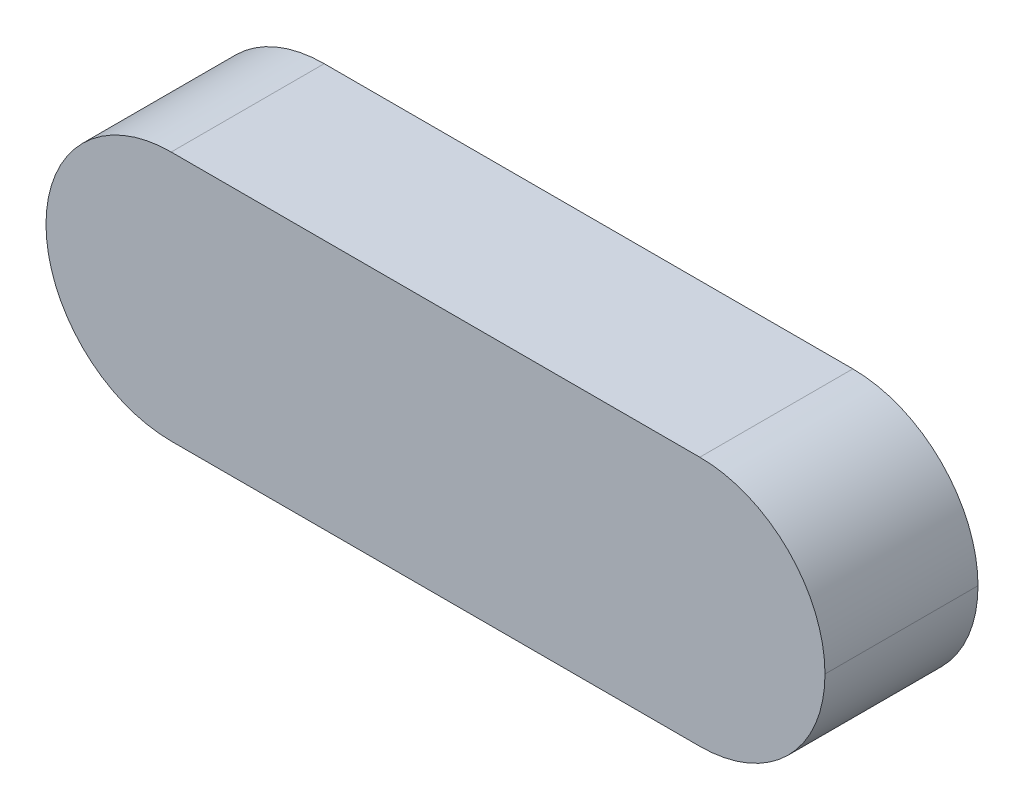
ISO-10303-21;
HEADER;
FILE_DESCRIPTION(('STEP AP214'),'2;1');
FILE_NAME('part.step','',(''),(''),'','','');
FILE_SCHEMA(('AUTOMOTIVE_DESIGN { 1 0 10303 214 1 1 1 1 }'));
ENDSEC;
DATA;
#1=APPLICATION_CONTEXT('core data for automotive mechanical design processes');
#2=APPLICATION_PROTOCOL_DEFINITION('international standard','automotive_design',2000,#1);
#3=PRODUCT_CONTEXT('',#1,'mechanical');
#4=PRODUCT('Part','Part','',(#3));
#5=PRODUCT_RELATED_PRODUCT_CATEGORY('part','',(#4));
#6=PRODUCT_DEFINITION_FORMATION('','',#4);
#7=PRODUCT_DEFINITION_CONTEXT('part definition',#1,'design');
#8=PRODUCT_DEFINITION('design','',#6,#7);
#9=PRODUCT_DEFINITION_SHAPE('','',#8);
#10=(LENGTH_UNIT() NAMED_UNIT(*) SI_UNIT(.MILLI.,.METRE.));
#11=(NAMED_UNIT(*) PLANE_ANGLE_UNIT() SI_UNIT($,.RADIAN.));
#12=(NAMED_UNIT(*) SI_UNIT($,.STERADIAN.) SOLID_ANGLE_UNIT());
#13=UNCERTAINTY_MEASURE_WITH_UNIT(LENGTH_MEASURE(1.E-05),#10,'distance_accuracy_value','');
#14=(GEOMETRIC_REPRESENTATION_CONTEXT(3) GLOBAL_UNCERTAINTY_ASSIGNED_CONTEXT((#13)) GLOBAL_UNIT_ASSIGNED_CONTEXT((#10,
#11,#12)) REPRESENTATION_CONTEXT('',''));
#15=CARTESIAN_POINT('',(0.,0.,0.));
#16=DIRECTION('',(0.,0.,1.));
#17=DIRECTION('',(1.,0.,0.));
#18=AXIS2_PLACEMENT_3D('',#15,#16,#17);
#19=CARTESIAN_POINT('',(28.,9.,11.));
#20=DIRECTION('',(0.,-1.,0.));
#21=DIRECTION('',(1.,0.,0.));
#22=AXIS2_PLACEMENT_3D('',#19,#20,#21);
#23=PLANE('',#22);
#24=DIRECTION('',(-1.,0.,0.));
#25=VECTOR('',#24,1.);
#26=CARTESIAN_POINT('',(28.,9.,0.));
#27=LINE('',#26,#25);
#28=CARTESIAN_POINT('',(19.,9.,0.));
#29=VERTEX_POINT('',#28);
#30=CARTESIAN_POINT('',(-19.,8.99999999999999,0.));
#31=VERTEX_POINT('',#30);
#32=EDGE_CURVE('E111',#29,#31,#27,.T.);
#33=ORIENTED_EDGE('',*,*,#32,.T.);
#34=DIRECTION('',(0.,0.,-1.));
#35=VECTOR('',#34,1.);
#36=CARTESIAN_POINT('',(-19.,8.99999999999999,11.));
#37=LINE('',#36,#35);
#38=CARTESIAN_POINT('',(-19.,8.99999999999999,11.));
#39=VERTEX_POINT('',#38);
#40=EDGE_CURVE('E11',#31,#39,#37,.F.);
#41=ORIENTED_EDGE('',*,*,#40,.T.);
#42=DIRECTION('',(-1.,0.,0.));
#43=VECTOR('',#42,1.);
#44=CARTESIAN_POINT('',(28.,9.,11.));
#45=LINE('',#44,#43);
#46=CARTESIAN_POINT('',(19.,9.,11.));
#47=VERTEX_POINT('',#46);
#48=EDGE_CURVE('E110',#47,#39,#45,.T.);
#49=ORIENTED_EDGE('',*,*,#48,.F.);
#50=DIRECTION('',(0.,0.,-1.));
#51=VECTOR('',#50,1.);
#52=CARTESIAN_POINT('',(19.,9.,11.));
#53=LINE('',#52,#51);
#54=EDGE_CURVE('E42',#47,#29,#53,.T.);
#55=ORIENTED_EDGE('',*,*,#54,.T.);
#56=EDGE_LOOP('',(#33,#41,#49,#55));
#57=FACE_BOUND('',#56,.T.);
#58=ADVANCED_FACE('F33',(#57),#23,.F.);
#59=CARTESIAN_POINT('',(28.,-9.,11.));
#60=DIRECTION('',(0.,-1.,0.));
#61=DIRECTION('',(1.,0.,0.));
#62=AXIS2_PLACEMENT_3D('',#59,#60,#61);
#63=PLANE('',#62);
#64=DIRECTION('',(-1.,0.,0.));
#65=VECTOR('',#64,1.);
#66=CARTESIAN_POINT('',(28.,-9.,11.));
#67=LINE('',#66,#65);
#68=CARTESIAN_POINT('',(19.,-9.,11.));
#69=VERTEX_POINT('',#68);
#70=CARTESIAN_POINT('',(-19.,-9.00000000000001,11.));
#71=VERTEX_POINT('',#70);
#72=EDGE_CURVE('E115',#69,#71,#67,.T.);
#73=ORIENTED_EDGE('',*,*,#72,.T.);
#74=DIRECTION('',(0.,0.,-1.));
#75=VECTOR('',#74,1.);
#76=CARTESIAN_POINT('',(-19.,-9.00000000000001,11.));
#77=LINE('',#76,#75);
#78=CARTESIAN_POINT('',(-19.,-9.00000000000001,0.));
#79=VERTEX_POINT('',#78);
#80=EDGE_CURVE('E109',#71,#79,#77,.T.);
#81=ORIENTED_EDGE('',*,*,#80,.T.);
#82=DIRECTION('',(-1.,0.,0.));
#83=VECTOR('',#82,1.);
#84=CARTESIAN_POINT('',(28.,-9.,0.));
#85=LINE('',#84,#83);
#86=CARTESIAN_POINT('',(19.,-9.,0.));
#87=VERTEX_POINT('',#86);
#88=EDGE_CURVE('E91',#87,#79,#85,.T.);
#89=ORIENTED_EDGE('',*,*,#88,.F.);
#90=DIRECTION('',(0.,0.,-1.));
#91=VECTOR('',#90,1.);
#92=CARTESIAN_POINT('',(19.,-9.,11.));
#93=LINE('',#92,#91);
#94=EDGE_CURVE('E106',#87,#69,#93,.F.);
#95=ORIENTED_EDGE('',*,*,#94,.T.);
#96=EDGE_LOOP('',(#73,#81,#89,#95));
#97=FACE_BOUND('',#96,.T.);
#98=ADVANCED_FACE('F105',(#97),#63,.T.);
#99=CARTESIAN_POINT('',(0.,0.,11.));
#100=DIRECTION('',(0.,0.,1.));
#101=DIRECTION('',(1.,0.,0.));
#102=AXIS2_PLACEMENT_3D('',#99,#100,#101);
#103=PLANE('',#102);
#104=CARTESIAN_POINT('',(-19.,0.,11.));
#105=DIRECTION('',(0.,0.,1.));
#106=DIRECTION('',(1.,0.,0.));
#107=AXIS2_PLACEMENT_3D('',#104,#105,#106);
#108=CIRCLE('',#107,9.);
#109=CARTESIAN_POINT('',(-28.,0.,11.));
#110=VERTEX_POINT('',#109);
#111=EDGE_CURVE('E50',#39,#110,#108,.T.);
#112=ORIENTED_EDGE('',*,*,#111,.T.);
#113=CARTESIAN_POINT('',(-19.,0.,11.));
#114=DIRECTION('',(0.,0.,1.));
#115=DIRECTION('',(1.,0.,0.));
#116=AXIS2_PLACEMENT_3D('',#113,#114,#115);
#117=CIRCLE('',#116,9.);
#118=EDGE_CURVE('E129',#110,#71,#117,.T.);
#119=ORIENTED_EDGE('',*,*,#118,.T.);
#120=ORIENTED_EDGE('',*,*,#72,.F.);
#121=CARTESIAN_POINT('',(19.,0.,11.));
#122=DIRECTION('',(0.,0.,1.));
#123=DIRECTION('',(1.,0.,0.));
#124=AXIS2_PLACEMENT_3D('',#121,#122,#123);
#125=CIRCLE('',#124,9.);
#126=CARTESIAN_POINT('',(28.,0.,11.));
#127=VERTEX_POINT('',#126);
#128=EDGE_CURVE('E114',#69,#127,#125,.T.);
#129=ORIENTED_EDGE('',*,*,#128,.T.);
#130=CARTESIAN_POINT('',(19.,0.,11.));
#131=DIRECTION('',(0.,0.,1.));
#132=DIRECTION('',(1.,0.,0.));
#133=AXIS2_PLACEMENT_3D('',#130,#131,#132);
#134=CIRCLE('',#133,9.);
#135=EDGE_CURVE('E125',#127,#47,#134,.T.);
#136=ORIENTED_EDGE('',*,*,#135,.T.);
#137=ORIENTED_EDGE('',*,*,#48,.T.);
#138=EDGE_LOOP('',(#112,#119,#120,#129,#136,#137));
#139=FACE_BOUND('',#138,.T.);
#140=ADVANCED_FACE('F138',(#139),#103,.T.);
#141=CARTESIAN_POINT('',(0.,0.,0.));
#142=DIRECTION('',(0.,0.,1.));
#143=DIRECTION('',(1.,0.,0.));
#144=AXIS2_PLACEMENT_3D('',#141,#142,#143);
#145=PLANE('',#144);
#146=ORIENTED_EDGE('',*,*,#88,.T.);
#147=CARTESIAN_POINT('',(-19.,0.,0.));
#148=DIRECTION('',(0.,0.,1.));
#149=DIRECTION('',(1.,0.,0.));
#150=AXIS2_PLACEMENT_3D('',#147,#148,#149);
#151=CIRCLE('',#150,9.);
#152=CARTESIAN_POINT('',(-28.,0.,0.));
#153=VERTEX_POINT('',#152);
#154=EDGE_CURVE('E123',#79,#153,#151,.F.);
#155=ORIENTED_EDGE('',*,*,#154,.T.);
#156=CARTESIAN_POINT('',(-19.,0.,0.));
#157=DIRECTION('',(0.,0.,1.));
#158=DIRECTION('',(1.,0.,0.));
#159=AXIS2_PLACEMENT_3D('',#156,#157,#158);
#160=CIRCLE('',#159,9.);
#161=EDGE_CURVE('E99',#153,#31,#160,.F.);
#162=ORIENTED_EDGE('',*,*,#161,.T.);
#163=ORIENTED_EDGE('',*,*,#32,.F.);
#164=CARTESIAN_POINT('',(19.,0.,0.));
#165=DIRECTION('',(0.,0.,1.));
#166=DIRECTION('',(1.,0.,0.));
#167=AXIS2_PLACEMENT_3D('',#164,#165,#166);
#168=CIRCLE('',#167,9.);
#169=CARTESIAN_POINT('',(28.,0.,0.));
#170=VERTEX_POINT('',#169);
#171=EDGE_CURVE('E94',#29,#170,#168,.F.);
#172=ORIENTED_EDGE('',*,*,#171,.T.);
#173=CARTESIAN_POINT('',(19.,0.,0.));
#174=DIRECTION('',(0.,0.,1.));
#175=DIRECTION('',(1.,0.,0.));
#176=AXIS2_PLACEMENT_3D('',#173,#174,#175);
#177=CIRCLE('',#176,9.);
#178=EDGE_CURVE('E88',#170,#87,#177,.F.);
#179=ORIENTED_EDGE('',*,*,#178,.T.);
#180=EDGE_LOOP('',(#146,#155,#162,#163,#172,#179));
#181=FACE_BOUND('',#180,.T.);
#182=ADVANCED_FACE('F90',(#181),#145,.F.);
#183=CARTESIAN_POINT('',(-19.,0.,11.));
#184=DIRECTION('',(0.,0.,1.));
#185=DIRECTION('',(1.,0.,0.));
#186=AXIS2_PLACEMENT_3D('',#183,#184,#185);
#187=CYLINDRICAL_SURFACE('',#186,9.);
#188=DIRECTION('',(0.,0.,-1.));
#189=VECTOR('',#188,1.);
#190=CARTESIAN_POINT('',(-28.,0.,0.));
#191=LINE('',#190,#189);
#192=EDGE_CURVE('E131',#110,#153,#191,.T.);
#193=ORIENTED_EDGE('',*,*,#192,.F.);
#194=ORIENTED_EDGE('',*,*,#111,.F.);
#195=ORIENTED_EDGE('',*,*,#40,.F.);
#196=ORIENTED_EDGE('',*,*,#161,.F.);
#197=EDGE_LOOP('',(#193,#194,#195,#196));
#198=FACE_BOUND('',#197,.T.);
#199=ADVANCED_FACE('F142',(#198),#187,.T.);
#200=CARTESIAN_POINT('',(-19.,0.,11.));
#201=DIRECTION('',(0.,0.,-1.));
#202=DIRECTION('',(-1.,0.,0.));
#203=AXIS2_PLACEMENT_3D('',#200,#201,#202);
#204=CYLINDRICAL_SURFACE('',#203,9.);
#205=ORIENTED_EDGE('',*,*,#118,.F.);
#206=ORIENTED_EDGE('',*,*,#192,.T.);
#207=ORIENTED_EDGE('',*,*,#154,.F.);
#208=ORIENTED_EDGE('',*,*,#80,.F.);
#209=EDGE_LOOP('',(#205,#206,#207,#208));
#210=FACE_BOUND('',#209,.T.);
#211=ADVANCED_FACE('F143',(#210),#204,.T.);
#212=CARTESIAN_POINT('',(19.,0.,11.));
#213=DIRECTION('',(0.,0.,-1.));
#214=DIRECTION('',(-1.,0.,0.));
#215=AXIS2_PLACEMENT_3D('',#212,#213,#214);
#216=CYLINDRICAL_SURFACE('',#215,9.);
#217=ORIENTED_EDGE('',*,*,#54,.F.);
#218=ORIENTED_EDGE('',*,*,#135,.F.);
#219=DIRECTION('',(0.,0.,-1.));
#220=VECTOR('',#219,1.);
#221=CARTESIAN_POINT('',(28.,0.,11.));
#222=LINE('',#221,#220);
#223=EDGE_CURVE('E37',#170,#127,#222,.F.);
#224=ORIENTED_EDGE('',*,*,#223,.F.);
#225=ORIENTED_EDGE('',*,*,#171,.F.);
#226=EDGE_LOOP('',(#217,#218,#224,#225));
#227=FACE_BOUND('',#226,.T.);
#228=ADVANCED_FACE('F35',(#227),#216,.T.);
#229=CARTESIAN_POINT('',(19.,0.,11.));
#230=DIRECTION('',(0.,0.,1.));
#231=DIRECTION('',(1.,0.,0.));
#232=AXIS2_PLACEMENT_3D('',#229,#230,#231);
#233=CYLINDRICAL_SURFACE('',#232,9.);
#234=ORIENTED_EDGE('',*,*,#128,.F.);
#235=ORIENTED_EDGE('',*,*,#94,.F.);
#236=ORIENTED_EDGE('',*,*,#178,.F.);
#237=ORIENTED_EDGE('',*,*,#223,.T.);
#238=EDGE_LOOP('',(#234,#235,#236,#237));
#239=FACE_BOUND('',#238,.T.);
#240=ADVANCED_FACE('F113',(#239),#233,.T.);
#241=CLOSED_SHELL('',(#58,#98,#140,#182,#199,#211,#228,#240));
#242=MANIFOLD_SOLID_BREP('B2',#241);
#243=ADVANCED_BREP_SHAPE_REPRESENTATION('',(#18,#242),#14);
#244=SHAPE_DEFINITION_REPRESENTATION(#9,#243);
ENDSEC;
END-ISO-10303-21;
